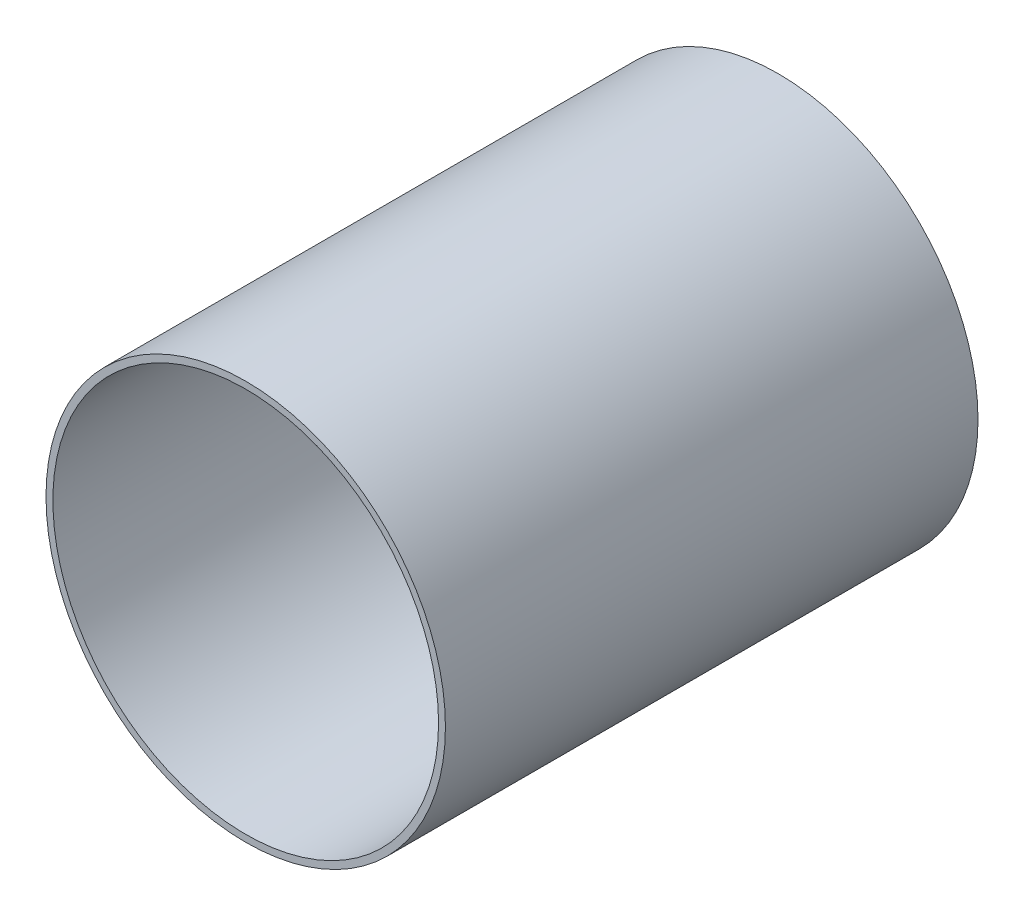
from build123d import *

# Parameters (mm, degrees)
SKETCH1_R           = 76.2
BOSS_EXTRUDE1_DEPTH = 203.2
SKETCH2_R           = 73.575190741
CUT_EXTRUDE1_DEPTH  = 304.8


with BuildPart() as part:
    # Sketch1 → Boss-Extrude1 (new body)
    with BuildSketch(Plane.XY):
        Circle(SKETCH1_R)
    extrude(amount=BOSS_EXTRUDE1_DEPTH)

    # Sketch2 → Cut-Extrude1 (cut)
    with BuildSketch(Plane.XY.offset(203.2)):
        Circle(SKETCH2_R)
    extrude(amount=-CUT_EXTRUDE1_DEPTH, mode=Mode.SUBTRACT)


solid = part.part
